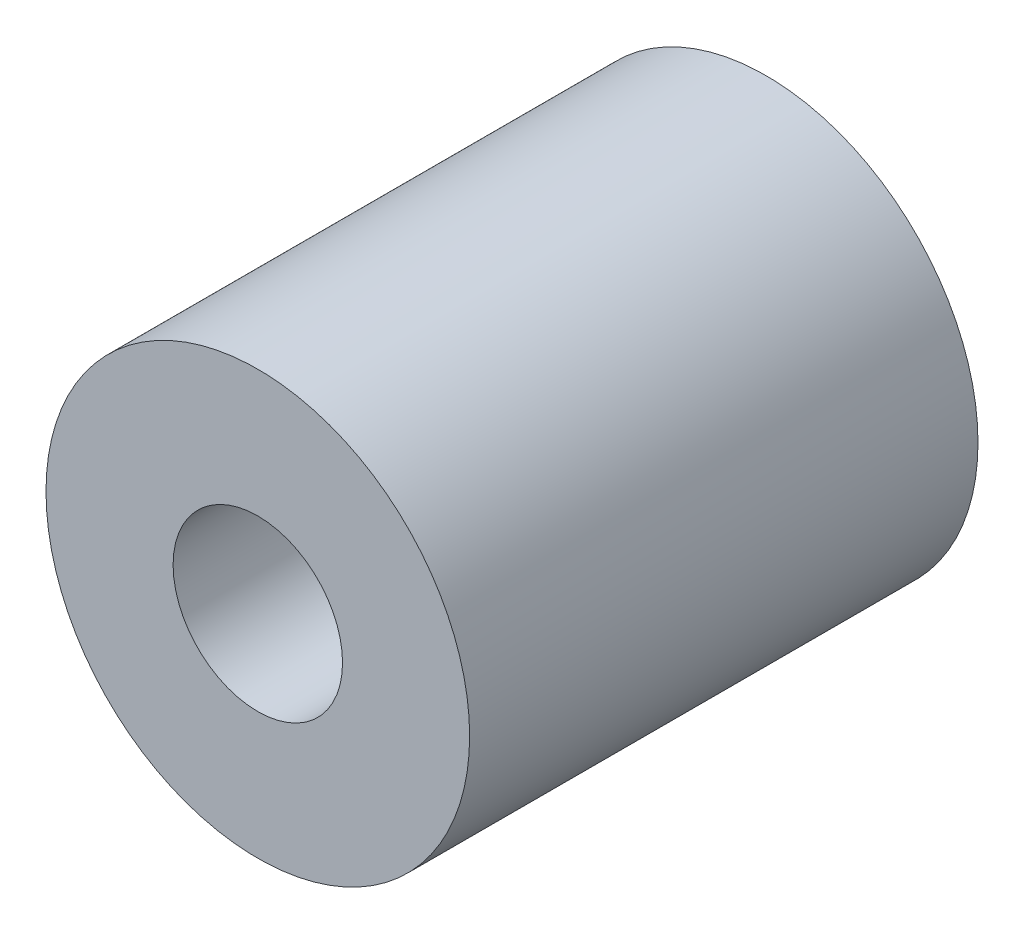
ISO-10303-21;
HEADER;
FILE_DESCRIPTION(('STEP AP214'),'2;1');
FILE_NAME('part.step','',(''),(''),'','','');
FILE_SCHEMA(('AUTOMOTIVE_DESIGN { 1 0 10303 214 1 1 1 1 }'));
ENDSEC;
DATA;
#1=APPLICATION_CONTEXT('core data for automotive mechanical design processes');
#2=APPLICATION_PROTOCOL_DEFINITION('international standard','automotive_design',2000,#1);
#3=PRODUCT_CONTEXT('',#1,'mechanical');
#4=PRODUCT('Part','Part','',(#3));
#5=PRODUCT_RELATED_PRODUCT_CATEGORY('part','',(#4));
#6=PRODUCT_DEFINITION_FORMATION('','',#4);
#7=PRODUCT_DEFINITION_CONTEXT('part definition',#1,'design');
#8=PRODUCT_DEFINITION('design','',#6,#7);
#9=PRODUCT_DEFINITION_SHAPE('','',#8);
#10=(LENGTH_UNIT() NAMED_UNIT(*) SI_UNIT(.MILLI.,.METRE.));
#11=(NAMED_UNIT(*) PLANE_ANGLE_UNIT() SI_UNIT($,.RADIAN.));
#12=(NAMED_UNIT(*) SI_UNIT($,.STERADIAN.) SOLID_ANGLE_UNIT());
#13=UNCERTAINTY_MEASURE_WITH_UNIT(LENGTH_MEASURE(1.E-05),#10,'distance_accuracy_value','');
#14=(GEOMETRIC_REPRESENTATION_CONTEXT(3) GLOBAL_UNCERTAINTY_ASSIGNED_CONTEXT((#13)) GLOBAL_UNIT_ASSIGNED_CONTEXT((#10,
#11,#12)) REPRESENTATION_CONTEXT('',''));
#15=CARTESIAN_POINT('',(0.,0.,0.));
#16=DIRECTION('',(0.,0.,1.));
#17=DIRECTION('',(1.,0.,0.));
#18=AXIS2_PLACEMENT_3D('',#15,#16,#17);
#19=CARTESIAN_POINT('',(0.,0.,12.));
#20=DIRECTION('',(0.,0.,-1.));
#21=DIRECTION('',(-1.,0.,0.));
#22=AXIS2_PLACEMENT_3D('',#19,#20,#21);
#23=CYLINDRICAL_SURFACE('',#22,5.);
#24=CARTESIAN_POINT('',(0.,0.,12.));
#25=DIRECTION('',(0.,0.,1.));
#26=DIRECTION('',(1.,0.,0.));
#27=AXIS2_PLACEMENT_3D('',#24,#25,#26);
#28=CIRCLE('',#27,5.);
#29=CARTESIAN_POINT('',(5.,0.,12.));
#30=VERTEX_POINT('',#29);
#31=EDGE_CURVE('E8',#30,#30,#28,.T.);
#32=ORIENTED_EDGE('',*,*,#31,.F.);
#33=EDGE_LOOP('',(#32));
#34=FACE_BOUND('',#33,.T.);
#35=CARTESIAN_POINT('',(0.,0.,0.));
#36=DIRECTION('',(0.,0.,1.));
#37=DIRECTION('',(1.,0.,0.));
#38=AXIS2_PLACEMENT_3D('',#35,#36,#37);
#39=CIRCLE('',#38,5.);
#40=CARTESIAN_POINT('',(5.,0.,0.));
#41=VERTEX_POINT('',#40);
#42=EDGE_CURVE('E18',#41,#41,#39,.T.);
#43=ORIENTED_EDGE('',*,*,#42,.T.);
#44=EDGE_LOOP('',(#43));
#45=FACE_BOUND('',#44,.T.);
#46=ADVANCED_FACE('F12',(#34,#45),#23,.T.);
#47=CARTESIAN_POINT('',(0.,0.,12.));
#48=DIRECTION('',(0.,0.,1.));
#49=DIRECTION('',(1.,0.,0.));
#50=AXIS2_PLACEMENT_3D('',#47,#48,#49);
#51=PLANE('',#50);
#52=CARTESIAN_POINT('',(0.,0.,12.));
#53=DIRECTION('',(0.,0.,-1.));
#54=DIRECTION('',(-1.,0.,0.));
#55=AXIS2_PLACEMENT_3D('',#52,#53,#54);
#56=CIRCLE('',#55,2.);
#57=CARTESIAN_POINT('',(-2.,0.,12.));
#58=VERTEX_POINT('',#57);
#59=EDGE_CURVE('E22',#58,#58,#56,.T.);
#60=ORIENTED_EDGE('',*,*,#59,.T.);
#61=EDGE_LOOP('',(#60));
#62=FACE_BOUND('',#61,.T.);
#63=ORIENTED_EDGE('',*,*,#31,.T.);
#64=EDGE_LOOP('',(#63));
#65=FACE_BOUND('',#64,.T.);
#66=ADVANCED_FACE('F37',(#62,#65),#51,.T.);
#67=CARTESIAN_POINT('',(0.,0.,0.));
#68=DIRECTION('',(0.,0.,1.));
#69=DIRECTION('',(1.,0.,0.));
#70=AXIS2_PLACEMENT_3D('',#67,#68,#69);
#71=PLANE('',#70);
#72=CARTESIAN_POINT('',(0.,0.,0.));
#73=DIRECTION('',(0.,0.,-1.));
#74=DIRECTION('',(-1.,0.,0.));
#75=AXIS2_PLACEMENT_3D('',#72,#73,#74);
#76=CIRCLE('',#75,2.);
#77=CARTESIAN_POINT('',(-2.,0.,0.));
#78=VERTEX_POINT('',#77);
#79=EDGE_CURVE('E26',#78,#78,#76,.T.);
#80=ORIENTED_EDGE('',*,*,#79,.F.);
#81=EDGE_LOOP('',(#80));
#82=FACE_BOUND('',#81,.T.);
#83=ORIENTED_EDGE('',*,*,#42,.F.);
#84=EDGE_LOOP('',(#83));
#85=FACE_BOUND('',#84,.T.);
#86=ADVANCED_FACE('F34',(#82,#85),#71,.F.);
#87=CARTESIAN_POINT('',(0.,0.,12.));
#88=DIRECTION('',(0.,0.,-1.));
#89=DIRECTION('',(-1.,0.,0.));
#90=AXIS2_PLACEMENT_3D('',#87,#88,#89);
#91=CYLINDRICAL_SURFACE('',#90,2.);
#92=ORIENTED_EDGE('',*,*,#59,.F.);
#93=EDGE_LOOP('',(#92));
#94=FACE_BOUND('',#93,.T.);
#95=ORIENTED_EDGE('',*,*,#79,.T.);
#96=EDGE_LOOP('',(#95));
#97=FACE_BOUND('',#96,.T.);
#98=ADVANCED_FACE('F32',(#94,#97),#91,.F.);
#99=CLOSED_SHELL('',(#46,#66,#86,#98));
#100=MANIFOLD_SOLID_BREP('B1',#99);
#101=ADVANCED_BREP_SHAPE_REPRESENTATION('',(#18,#100),#14);
#102=SHAPE_DEFINITION_REPRESENTATION(#9,#101);
ENDSEC;
END-ISO-10303-21;
